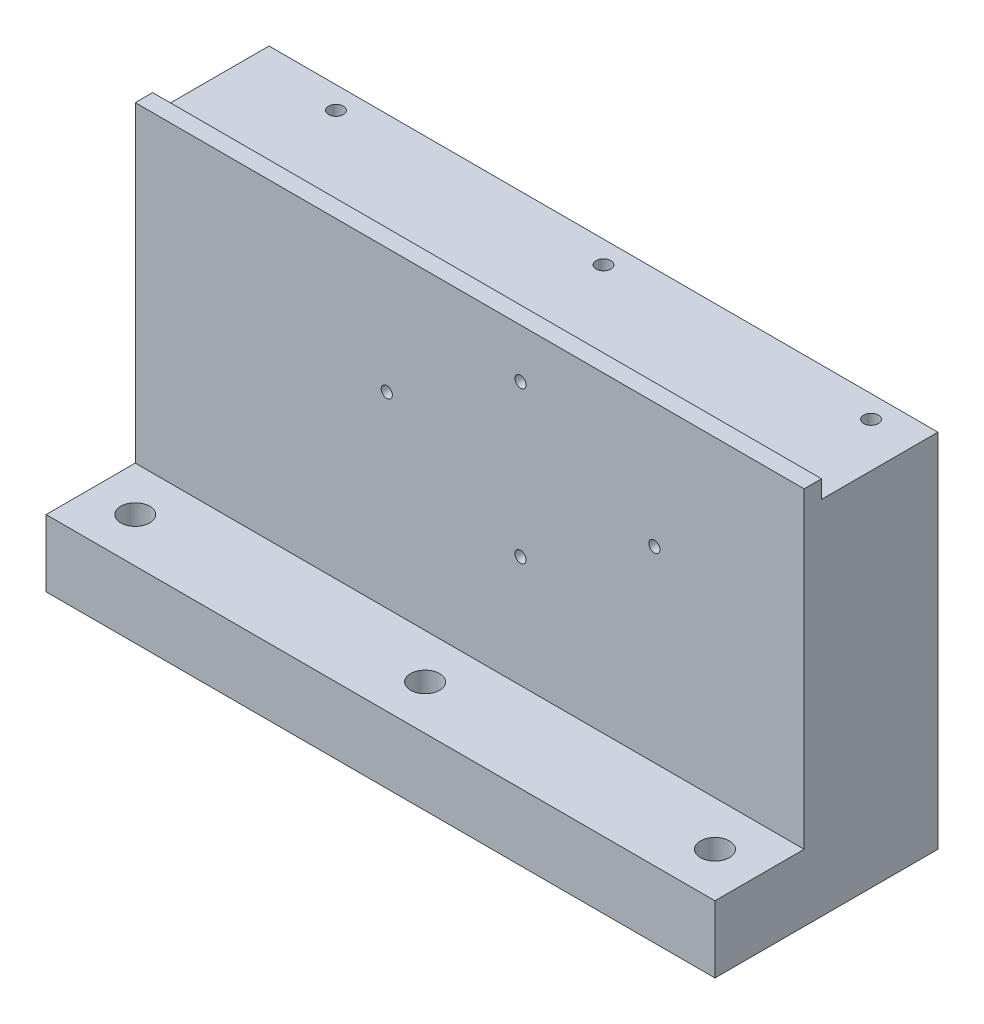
from build123d import *

# Parameters (mm, degrees)
SKETCH_1_W          = 150
SKETCH_1_H          = 85
EXTRUDE_1_DEPTH     = 50
SKETCH_2_OUTSIDE_W  = 87.902
SKETCH_2_OUTSIDE_H  = 122.902
CUT_EXTRUDE_1_DEPTH = 180.51323071
SKETCH_3_R          = 1.25
CUT_EXTRUDE_2_DEPTH = 10
SKETCH_5_R          = 1.65
CUT_EXTRUDE_3_DEPTH = 10
SKETCH_7_R          = 2.1
CUT_EXTRUDE_4_DEPTH = 10
SKETCH_8_R          = 1.65
CUT_EXTRUDE_5_DEPTH = 10
SKETCH_9_R          = 3.25
CUT_EXTRUDE_6_DEPTH = 173.916164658


with BuildPart() as part:
    # Sketch 1 → Extrude 1 (new body)
    with BuildSketch(Plane.XY):
        with Locations((75, 42.5)):
            Rectangle(SKETCH_1_W, SKETCH_1_H)
    extrude(amount=EXTRUDE_1_DEPTH)

    # Sketch 2 outside → Cut-Extrude 1 (cut, through all)
    with BuildSketch(Plane(origin=(150, 0, 0), x_dir=(0, 0, -1), z_dir=(1, 0, 0))):
        with Locations((-25, 42.5)):
            Rectangle(SKETCH_2_OUTSIDE_W, SKETCH_2_OUTSIDE_H)
        Polygon((-26.1, 81), (-26.1, 85), (-30, 85), (-30, 15), (-50, 15), (-50, 0), (0, 0), (0, 81), align=None, mode=Mode.SUBTRACT)
    extrude(amount=-CUT_EXTRUDE_1_DEPTH, mode=Mode.SUBTRACT)

    # Sketch 3 → Cut-Extrude 2 (cut)
    with BuildSketch(Plane.XY.offset(30)):
        with Locations((56.4, 57)):
            Circle(SKETCH_3_R)
        with Locations((116.4, 57)):
            Circle(SKETCH_3_R)
        with Locations((86.4, 74)):
            Circle(SKETCH_3_R)
        with Locations((86.4, 40)):
            Circle(SKETCH_3_R)
    extrude(amount=-CUT_EXTRUDE_2_DEPTH, mode=Mode.SUBTRACT)

    # Sketch 5 → Cut-Extrude 3 (cut)
    with BuildSketch(Plane(origin=(0, 0, 0), x_dir=(-1, 0, 0), z_dir=(0, 0, -1))):
        with Locations((-146.25, 70)):
            Circle(SKETCH_5_R)
        with Locations((-116.25, 70)):
            Circle(SKETCH_5_R)
    extrude(amount=-CUT_EXTRUDE_3_DEPTH, mode=Mode.SUBTRACT)

    # Sketch 7 → Cut-Extrude 4 (cut)
    with BuildSketch(Plane.ZY):
        with Locations((6, 62)):
            Circle(SKETCH_7_R)
        with Locations((24, 62)):
            Circle(SKETCH_7_R)
    extrude(amount=-CUT_EXTRUDE_4_DEPTH, mode=Mode.SUBTRACT)

    # Sketch 8 → Cut-Extrude 5 (cut)
    with BuildSketch(Plane(origin=(0, 81, 0), x_dir=(1, 0, 0), z_dir=(0, 1, 0))):
        with Locations(Location((20, -5, 0), (0, 0, 270))):
            Circle(SKETCH_8_R)
        with Locations(Location((140, -5, 0), (0, 0, 270))):
            Circle(SKETCH_8_R)
        with Locations(Location((80, -5, 0), (0, 0, 270))):
            Circle(SKETCH_8_R)
    extrude(amount=-CUT_EXTRUDE_5_DEPTH, mode=Mode.SUBTRACT)

    # Sketch 9 → Cut-Extrude 6 (cut, through all)
    with BuildSketch(Plane(origin=(0, 15, 0), x_dir=(1, 0, 0), z_dir=(0, 1, 0))):
        with Locations(Location((10, -40, 0), (0, 0, 270))):
            Circle(SKETCH_9_R)
        with Locations(Location((75, -40, 0), (0, 0, 270))):
            Circle(SKETCH_9_R)
        with Locations(Location((140, -40, 0), (0, 0, 270))):
            Circle(SKETCH_9_R)
    extrude(amount=-CUT_EXTRUDE_6_DEPTH, mode=Mode.SUBTRACT)


solid = part.part
